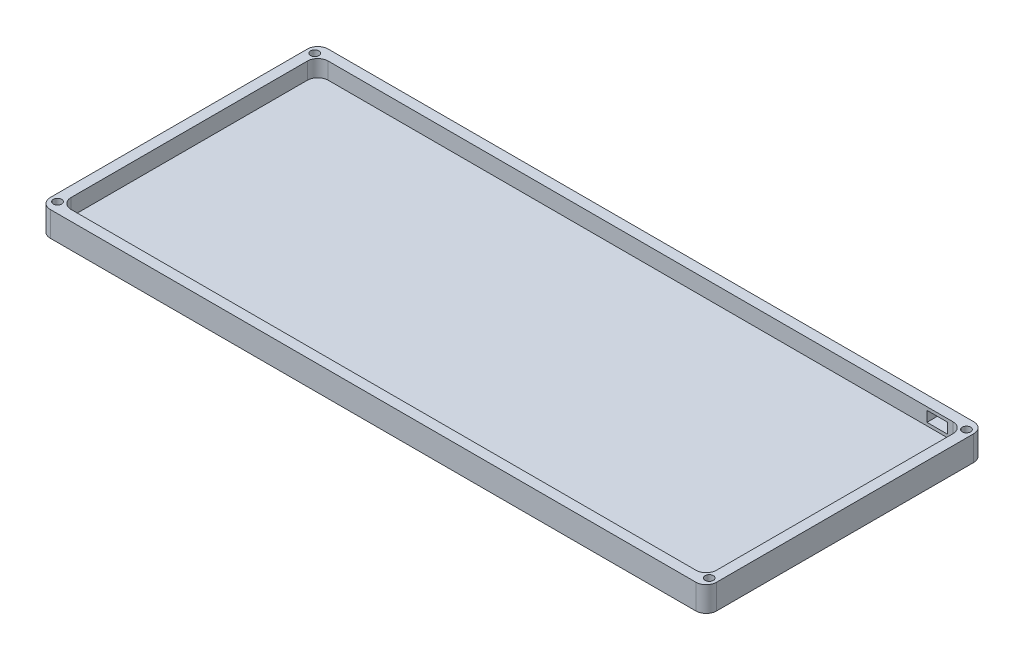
from build123d import *

# Parameters (mm, degrees)
SKETCH1_W           = 320.5
SKETCH1_H           = 133.675
SKETCH1_W_2         = 310.5
SKETCH1_H_2         = 123.675
BOSS_EXTRUDE1_DEPTH = 12
SKETCH1_3_W         = 310.5
SKETCH1_3_H         = 123.675
BOSS_EXTRUDE2_DEPTH = 4
FILLET2_R           = 5
SKETCH2_R           = 2
CUT_EXTRUDE1_DEPTH  = 40
SKETCH3_W           = 10
SKETCH3_H           = 5
CUT_EXTRUDE2_DEPTH  = 10


with BuildPart() as part:
    # Sketch1 → Boss-Extrude1 (new body)
    with BuildSketch(Plane(origin=(0, 0, 0), x_dir=(1, 0, 0), z_dir=(0, 1, 0))):
        Rectangle(SKETCH1_W, SKETCH1_H)
        Rectangle(SKETCH1_W_2, SKETCH1_H_2, mode=Mode.SUBTRACT)
    extrude(amount=BOSS_EXTRUDE1_DEPTH)

    # Sketch1_3 → Boss-Extrude2 (add)
    with BuildSketch(Plane(origin=(0, 0, 0), x_dir=(1, 0, 0), z_dir=(0, 1, 0))):
        Rectangle(SKETCH1_3_W, SKETCH1_3_H)
    extrude(amount=BOSS_EXTRUDE2_DEPTH)

    # Fillet2
    fillet2_edges = [part.edges().sort_by_distance(p)[0] for p in [
        (-155.25, 8, -61.8375),
        (-155.25, 8, 61.8375),
        (155.25, 8, 61.8375),
        (155.25, 8, -61.8375),
        (160.25, 6, -66.8375),
        (160.25, 6, 66.8375),
        (-160.25, 6, 66.8375),
        (-160.25, 6, -66.8375),
    ]]
    fillet(fillet2_edges, radius=FILLET2_R)

    # Sketch2 → Cut-Extrude1 (cut)
    with BuildSketch(Plane(origin=(0, 12, 0), x_dir=(1, 0, 0), z_dir=(0, 1, 0))):
        with Locations(Location((-156.75, 61.8375, 0), (0, 0, 270))):
            Circle(SKETCH2_R)
        with Locations(Location((156.75, 61.8375, 0), (0, 0, 270))):
            Circle(SKETCH2_R)
        with Locations(Location((-156.75, -61.8625, 0), (0, 0, 270))):
            Circle(SKETCH2_R)
        with Locations(Location((156.75, -61.8625, 0), (0, 0, 270))):
            Circle(SKETCH2_R)
    extrude(amount=-CUT_EXTRUDE1_DEPTH, mode=Mode.SUBTRACT)

    # Sketch3 → Cut-Extrude2 (cut)
    with BuildSketch(Plane(origin=(0, 0, -66.8375), x_dir=(-1, 0, 0), z_dir=(0, 0, -1))):
        with Locations((-142.75, 8)):
            Rectangle(SKETCH3_W, SKETCH3_H)
    extrude(amount=-CUT_EXTRUDE2_DEPTH, mode=Mode.SUBTRACT)


solid = part.part
